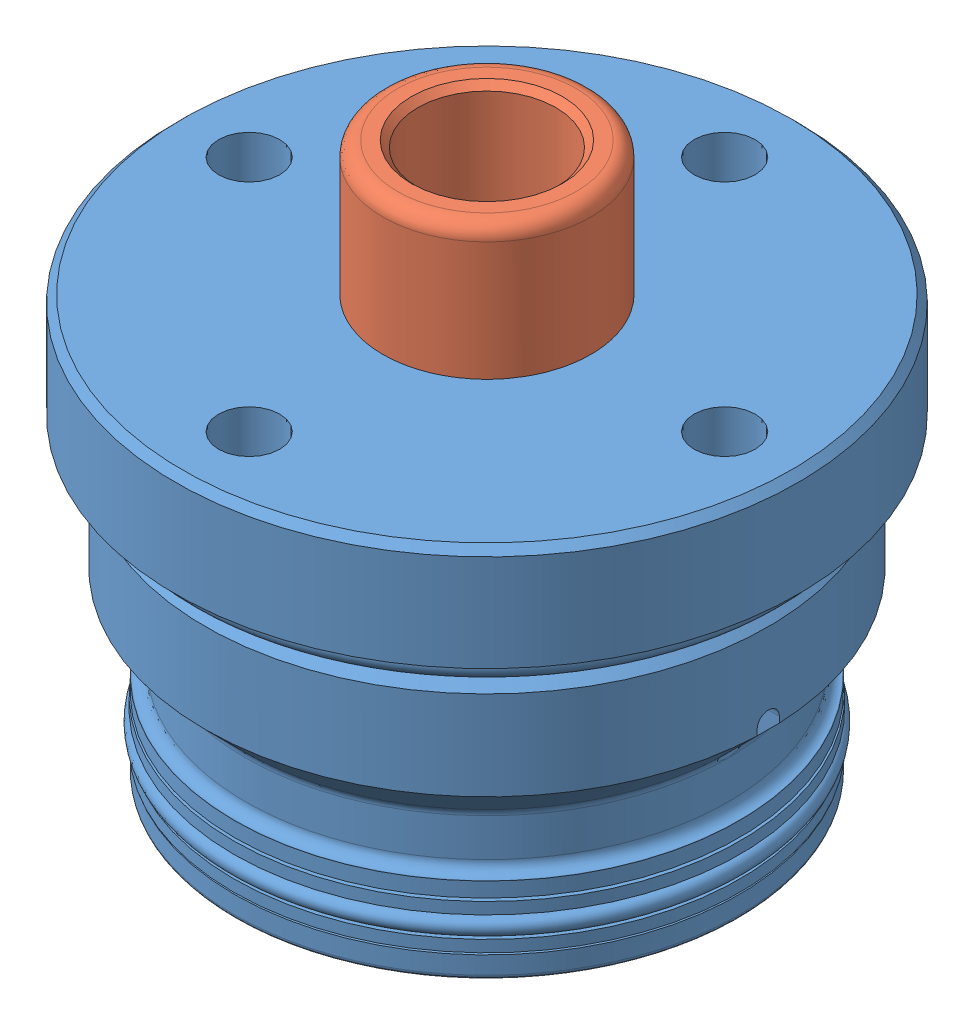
SolidWorks assembly ILC21021601.sldasm, configuration Default (file format 3400). Lengths in mm.
Overall size (66.55 58.74 66.55).
2 component instances, 2 part files, 3 mates.
Components (placement in the parent):
- ILC21021601_BODY-1: ILC21021601_BODY.sldprt [Default] at origin size (66.55 44.45 66.55)
- ILC21021601_PLUNGER-1: ILC21021601_PLUNGER.sldprt [Default] at (0 4.7625 0) x (0 1 0) z (0 0 1) size (53.98 44.45 44.45)
Mates (geometry in assembly coordinates):
- MID STROKE: distance = 4.7625 mm aligned: plane of ILC21021601_BODY-1 through (-26.9494 0 0) normal (0 -1 0); plane of ILC21021601_PLUNGER-1 through (-8.128 4.7625 0) normal (0 -1 0)
- Concentric1: concentric aligned: cylinder of ILC21021601_BODY-1; cylinder of ILC21021601_PLUNGER-1
- Coincident2: coincident aligned: unknown of ILC21021601_PLUNGER-1
